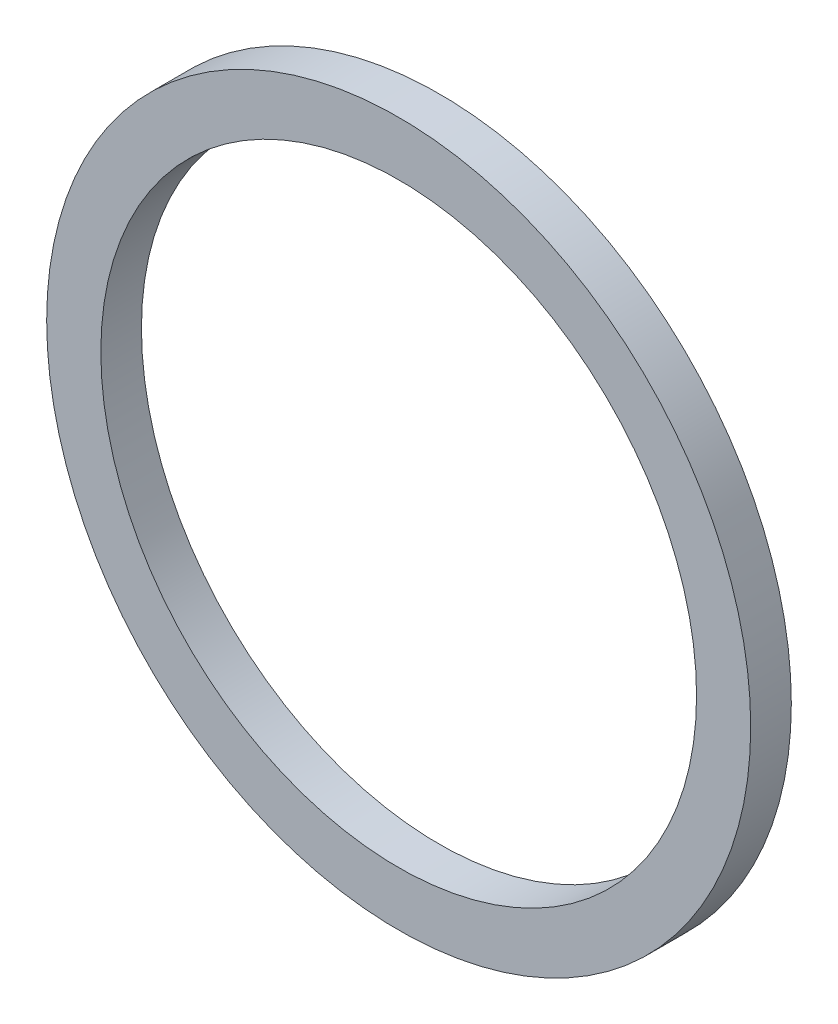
ISO-10303-21;
HEADER;
FILE_DESCRIPTION(('STEP AP214'),'2;1');
FILE_NAME('part.step','',(''),(''),'','','');
FILE_SCHEMA(('AUTOMOTIVE_DESIGN { 1 0 10303 214 1 1 1 1 }'));
ENDSEC;
DATA;
#1=APPLICATION_CONTEXT('core data for automotive mechanical design processes');
#2=APPLICATION_PROTOCOL_DEFINITION('international standard','automotive_design',2000,#1);
#3=PRODUCT_CONTEXT('',#1,'mechanical');
#4=PRODUCT('Part','Part','',(#3));
#5=PRODUCT_RELATED_PRODUCT_CATEGORY('part','',(#4));
#6=PRODUCT_DEFINITION_FORMATION('','',#4);
#7=PRODUCT_DEFINITION_CONTEXT('part definition',#1,'design');
#8=PRODUCT_DEFINITION('design','',#6,#7);
#9=PRODUCT_DEFINITION_SHAPE('','',#8);
#10=(LENGTH_UNIT() NAMED_UNIT(*) SI_UNIT(.MILLI.,.METRE.));
#11=(NAMED_UNIT(*) PLANE_ANGLE_UNIT() SI_UNIT($,.RADIAN.));
#12=(NAMED_UNIT(*) SI_UNIT($,.STERADIAN.) SOLID_ANGLE_UNIT());
#13=UNCERTAINTY_MEASURE_WITH_UNIT(LENGTH_MEASURE(1.E-05),#10,'distance_accuracy_value','');
#14=(GEOMETRIC_REPRESENTATION_CONTEXT(3) GLOBAL_UNCERTAINTY_ASSIGNED_CONTEXT((#13)) GLOBAL_UNIT_ASSIGNED_CONTEXT((#10,
#11,#12)) REPRESENTATION_CONTEXT('',''));
#15=CARTESIAN_POINT('',(0.,0.,0.));
#16=DIRECTION('',(0.,0.,1.));
#17=DIRECTION('',(1.,0.,0.));
#18=AXIS2_PLACEMENT_3D('',#15,#16,#17);
#19=CARTESIAN_POINT('',(0.,0.,1.5));
#20=DIRECTION('',(0.,0.,1.));
#21=DIRECTION('',(1.,0.,0.));
#22=AXIS2_PLACEMENT_3D('',#19,#20,#21);
#23=PLANE('',#22);
#24=CARTESIAN_POINT('',(0.,0.,1.5));
#25=DIRECTION('',(0.,0.,1.));
#26=DIRECTION('',(1.,0.,0.));
#27=AXIS2_PLACEMENT_3D('',#24,#25,#26);
#28=CIRCLE('',#27,13.);
#29=CARTESIAN_POINT('',(13.,0.,1.5));
#30=VERTEX_POINT('',#29);
#31=EDGE_CURVE('E10',#30,#30,#28,.T.);
#32=ORIENTED_EDGE('',*,*,#31,.T.);
#33=EDGE_LOOP('',(#32));
#34=FACE_BOUND('',#33,.T.);
#35=CARTESIAN_POINT('',(0.,0.,1.5));
#36=DIRECTION('',(0.,0.,1.));
#37=DIRECTION('',(1.,0.,0.));
#38=AXIS2_PLACEMENT_3D('',#35,#36,#37);
#39=CIRCLE('',#38,11.);
#40=CARTESIAN_POINT('',(11.,0.,1.5));
#41=VERTEX_POINT('',#40);
#42=EDGE_CURVE('E42',#41,#41,#39,.T.);
#43=ORIENTED_EDGE('',*,*,#42,.F.);
#44=EDGE_LOOP('',(#43));
#45=FACE_BOUND('',#44,.T.);
#46=ADVANCED_FACE('F31',(#34,#45),#23,.T.);
#47=CARTESIAN_POINT('',(0.,0.,0.));
#48=DIRECTION('',(0.,0.,1.));
#49=DIRECTION('',(1.,0.,0.));
#50=AXIS2_PLACEMENT_3D('',#47,#48,#49);
#51=PLANE('',#50);
#52=CARTESIAN_POINT('',(0.,0.,0.));
#53=DIRECTION('',(0.,0.,1.));
#54=DIRECTION('',(1.,0.,0.));
#55=AXIS2_PLACEMENT_3D('',#52,#53,#54);
#56=CIRCLE('',#55,13.);
#57=CARTESIAN_POINT('',(13.,0.,0.));
#58=VERTEX_POINT('',#57);
#59=EDGE_CURVE('E35',#58,#58,#56,.T.);
#60=ORIENTED_EDGE('',*,*,#59,.F.);
#61=EDGE_LOOP('',(#60));
#62=FACE_BOUND('',#61,.T.);
#63=CARTESIAN_POINT('',(0.,0.,0.));
#64=DIRECTION('',(0.,0.,1.));
#65=DIRECTION('',(1.,0.,0.));
#66=AXIS2_PLACEMENT_3D('',#63,#64,#65);
#67=CIRCLE('',#66,11.);
#68=CARTESIAN_POINT('',(11.,0.,0.));
#69=VERTEX_POINT('',#68);
#70=EDGE_CURVE('E44',#69,#69,#67,.T.);
#71=ORIENTED_EDGE('',*,*,#70,.T.);
#72=EDGE_LOOP('',(#71));
#73=FACE_BOUND('',#72,.T.);
#74=ADVANCED_FACE('F54',(#62,#73),#51,.F.);
#75=CARTESIAN_POINT('',(0.,0.,1.5));
#76=DIRECTION('',(0.,0.,-1.));
#77=DIRECTION('',(-1.,0.,0.));
#78=AXIS2_PLACEMENT_3D('',#75,#76,#77);
#79=CYLINDRICAL_SURFACE('',#78,13.);
#80=ORIENTED_EDGE('',*,*,#31,.F.);
#81=EDGE_LOOP('',(#80));
#82=FACE_BOUND('',#81,.T.);
#83=ORIENTED_EDGE('',*,*,#59,.T.);
#84=EDGE_LOOP('',(#83));
#85=FACE_BOUND('',#84,.T.);
#86=ADVANCED_FACE('F33',(#82,#85),#79,.T.);
#87=CARTESIAN_POINT('',(0.,0.,1.5));
#88=DIRECTION('',(0.,0.,-1.));
#89=DIRECTION('',(-1.,0.,0.));
#90=AXIS2_PLACEMENT_3D('',#87,#88,#89);
#91=CYLINDRICAL_SURFACE('',#90,11.);
#92=ORIENTED_EDGE('',*,*,#42,.T.);
#93=EDGE_LOOP('',(#92));
#94=FACE_BOUND('',#93,.T.);
#95=ORIENTED_EDGE('',*,*,#70,.F.);
#96=EDGE_LOOP('',(#95));
#97=FACE_BOUND('',#96,.T.);
#98=ADVANCED_FACE('F50',(#94,#97),#91,.F.);
#99=CLOSED_SHELL('',(#46,#74,#86,#98));
#100=MANIFOLD_SOLID_BREP('B2',#99);
#101=ADVANCED_BREP_SHAPE_REPRESENTATION('',(#18,#100),#14);
#102=SHAPE_DEFINITION_REPRESENTATION(#9,#101);
ENDSEC;
END-ISO-10303-21;
